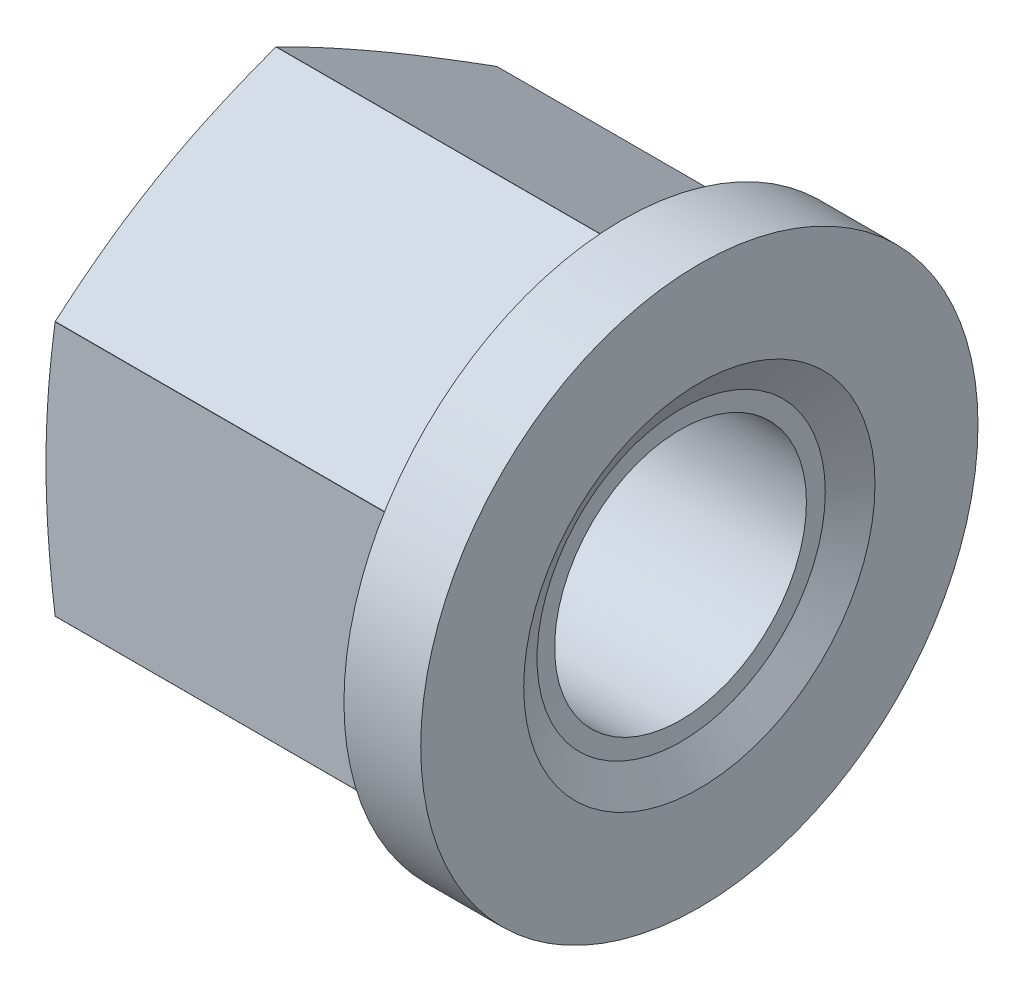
ISO-10303-21;
HEADER;
FILE_DESCRIPTION(('STEP AP214'),'2;1');
FILE_NAME('part.step','',(''),(''),'','','');
FILE_SCHEMA(('AUTOMOTIVE_DESIGN { 1 0 10303 214 1 1 1 1 }'));
ENDSEC;
DATA;
#1=APPLICATION_CONTEXT('core data for automotive mechanical design processes');
#2=APPLICATION_PROTOCOL_DEFINITION('international standard','automotive_design',2000,#1);
#3=PRODUCT_CONTEXT('',#1,'mechanical');
#4=PRODUCT('Part','Part','',(#3));
#5=PRODUCT_RELATED_PRODUCT_CATEGORY('part','',(#4));
#6=PRODUCT_DEFINITION_FORMATION('','',#4);
#7=PRODUCT_DEFINITION_CONTEXT('part definition',#1,'design');
#8=PRODUCT_DEFINITION('design','',#6,#7);
#9=PRODUCT_DEFINITION_SHAPE('','',#8);
#10=(LENGTH_UNIT() NAMED_UNIT(*) SI_UNIT(.MILLI.,.METRE.));
#11=(NAMED_UNIT(*) PLANE_ANGLE_UNIT() SI_UNIT($,.RADIAN.));
#12=(NAMED_UNIT(*) SI_UNIT($,.STERADIAN.) SOLID_ANGLE_UNIT());
#13=UNCERTAINTY_MEASURE_WITH_UNIT(LENGTH_MEASURE(1.E-05),#10,'distance_accuracy_value','');
#14=(GEOMETRIC_REPRESENTATION_CONTEXT(3) GLOBAL_UNCERTAINTY_ASSIGNED_CONTEXT((#13)) GLOBAL_UNIT_ASSIGNED_CONTEXT((#10,
#11,#12)) REPRESENTATION_CONTEXT('',''));
#15=CARTESIAN_POINT('',(0.,0.,0.));
#16=DIRECTION('',(0.,0.,1.));
#17=DIRECTION('',(1.,0.,0.));
#18=AXIS2_PLACEMENT_3D('',#15,#16,#17);
#19=CARTESIAN_POINT('',(-8.,29.,0.));
#20=DIRECTION('',(-1.,0.,0.));
#21=DIRECTION('',(0.,0.,1.));
#22=AXIS2_PLACEMENT_3D('',#19,#20,#21);
#23=PLANE('',#22);
#24=DIRECTION('',(0.,-0.5,0.866025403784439));
#25=VECTOR('',#24,1.);
#26=CARTESIAN_POINT('',(-8.,27.1685842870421,-1.05736835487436));
#27=LINE('',#26,#25);
#28=CARTESIAN_POINT('',(-8.,13.2871722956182,22.9859424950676));
#29=VERTEX_POINT('',#28);
#30=CARTESIAN_POINT('',(-8.,13.2790561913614,23.));
#31=VERTEX_POINT('',#30);
#32=EDGE_CURVE('E194',#29,#31,#27,.T.);
#33=ORIENTED_EDGE('',*,*,#32,.F.);
#34=CARTESIAN_POINT('',(-8.,0.,0.));
#35=DIRECTION('',(1.,0.,0.));
#36=DIRECTION('',(0.,0.,-1.));
#37=AXIS2_PLACEMENT_3D('',#34,#35,#36);
#38=CIRCLE('',#37,26.55);
#39=CARTESIAN_POINT('',(-8.,13.2628239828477,23.));
#40=VERTEX_POINT('',#39);
#41=EDGE_CURVE('E458',#29,#40,#38,.T.);
#42=ORIENTED_EDGE('',*,*,#41,.T.);
#43=DIRECTION('',(0.,-1.,0.));
#44=VECTOR('',#43,1.);
#45=CARTESIAN_POINT('',(-8.,29.,23.));
#46=LINE('',#45,#44);
#47=EDGE_CURVE('E257',#31,#40,#46,.T.);
#48=ORIENTED_EDGE('',*,*,#47,.F.);
#49=EDGE_LOOP('',(#33,#42,#48));
#50=FACE_BOUND('',#49,.T.);
#51=ADVANCED_FACE('F36',(#50),#23,.T.);
#52=CARTESIAN_POINT('',(-8.,-13.2628239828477,23.));
#53=VERTEX_POINT('',#52);
#54=CARTESIAN_POINT('',(-8.,-13.2790561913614,23.));
#55=VERTEX_POINT('',#54);
#56=EDGE_CURVE('E255',#53,#55,#46,.T.);
#57=ORIENTED_EDGE('',*,*,#56,.F.);
#58=CARTESIAN_POINT('',(-8.,-13.2871722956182,22.9859424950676));
#59=VERTEX_POINT('',#58);
#60=EDGE_CURVE('E456',#53,#59,#38,.T.);
#61=ORIENTED_EDGE('',*,*,#60,.T.);
#62=DIRECTION('',(0.,-0.5,-0.866025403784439));
#63=VECTOR('',#62,1.);
#64=CARTESIAN_POINT('',(-8.,-12.6685842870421,24.0573683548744));
#65=LINE('',#64,#63);
#66=EDGE_CURVE('E250',#55,#59,#65,.T.);
#67=ORIENTED_EDGE('',*,*,#66,.F.);
#68=EDGE_LOOP('',(#57,#61,#67));
#69=FACE_BOUND('',#68,.T.);
#70=ADVANCED_FACE('F369',(#69),#23,.T.);
#71=CARTESIAN_POINT('',(-8.,-26.5499962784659,0.0140575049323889));
#72=VERTEX_POINT('',#71);
#73=CARTESIAN_POINT('',(-8.,-26.5581123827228,0.));
#74=VERTEX_POINT('',#73);
#75=EDGE_CURVE('E248',#72,#74,#65,.T.);
#76=ORIENTED_EDGE('',*,*,#75,.F.);
#77=CARTESIAN_POINT('',(-8.,-26.5499962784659,-0.0140575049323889));
#78=VERTEX_POINT('',#77);
#79=EDGE_CURVE('E453',#72,#78,#38,.T.);
#80=ORIENTED_EDGE('',*,*,#79,.T.);
#81=DIRECTION('',(0.,0.5,-0.866025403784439));
#82=VECTOR('',#81,1.);
#83=CARTESIAN_POINT('',(-8.,-12.6685842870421,-24.0573683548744));
#84=LINE('',#83,#82);
#85=EDGE_CURVE('E243',#74,#78,#84,.T.);
#86=ORIENTED_EDGE('',*,*,#85,.F.);
#87=EDGE_LOOP('',(#76,#80,#86));
#88=FACE_BOUND('',#87,.T.);
#89=ADVANCED_FACE('F376',(#88),#23,.T.);
#90=CARTESIAN_POINT('',(-8.,-13.2871722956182,-22.9859424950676));
#91=VERTEX_POINT('',#90);
#92=CARTESIAN_POINT('',(-8.,-13.2790561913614,-23.));
#93=VERTEX_POINT('',#92);
#94=EDGE_CURVE('E241',#91,#93,#84,.T.);
#95=ORIENTED_EDGE('',*,*,#94,.F.);
#96=CARTESIAN_POINT('',(-8.,-13.2628239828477,-23.));
#97=VERTEX_POINT('',#96);
#98=EDGE_CURVE('E272',#91,#97,#38,.T.);
#99=ORIENTED_EDGE('',*,*,#98,.T.);
#100=DIRECTION('',(0.,1.,0.));
#101=VECTOR('',#100,1.);
#102=CARTESIAN_POINT('',(-8.,29.,-23.));
#103=LINE('',#102,#101);
#104=EDGE_CURVE('E236',#93,#97,#103,.T.);
#105=ORIENTED_EDGE('',*,*,#104,.F.);
#106=EDGE_LOOP('',(#95,#99,#105));
#107=FACE_BOUND('',#106,.T.);
#108=ADVANCED_FACE('F393',(#107),#23,.T.);
#109=CARTESIAN_POINT('',(-8.,13.2628239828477,-23.));
#110=VERTEX_POINT('',#109);
#111=CARTESIAN_POINT('',(-8.,13.2790561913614,-23.));
#112=VERTEX_POINT('',#111);
#113=EDGE_CURVE('E234',#110,#112,#103,.T.);
#114=ORIENTED_EDGE('',*,*,#113,.F.);
#115=CARTESIAN_POINT('',(-8.,13.2871722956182,-22.9859424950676));
#116=VERTEX_POINT('',#115);
#117=EDGE_CURVE('E274',#110,#116,#38,.T.);
#118=ORIENTED_EDGE('',*,*,#117,.T.);
#119=DIRECTION('',(0.,0.5,0.866025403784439));
#120=VECTOR('',#119,1.);
#121=CARTESIAN_POINT('',(-8.,27.1685842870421,1.05736835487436));
#122=LINE('',#121,#120);
#123=EDGE_CURVE('E229',#112,#116,#122,.T.);
#124=ORIENTED_EDGE('',*,*,#123,.F.);
#125=EDGE_LOOP('',(#114,#118,#124));
#126=FACE_BOUND('',#125,.T.);
#127=ADVANCED_FACE('F382',(#126),#23,.T.);
#128=CARTESIAN_POINT('',(0.,0.,0.));
#129=DIRECTION('',(1.,0.,0.));
#130=DIRECTION('',(0.,0.,-1.));
#131=AXIS2_PLACEMENT_3D('',#128,#129,#130);
#132=CYLINDRICAL_SURFACE('',#131,26.55);
#133=DIRECTION('',(1.,0.,0.));
#134=VECTOR('',#133,1.);
#135=CARTESIAN_POINT('',(0.,26.5499962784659,0.0140575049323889));
#136=LINE('',#135,#134);
#137=CARTESIAN_POINT('',(-8.,26.5499962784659,0.0140575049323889));
#138=VERTEX_POINT('',#137);
#139=CARTESIAN_POINT('',(-44.0487803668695,26.5499962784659,0.014057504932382));
#140=VERTEX_POINT('',#139);
#141=EDGE_CURVE('E260',#138,#140,#136,.F.);
#142=ORIENTED_EDGE('',*,*,#141,.F.);
#143=CARTESIAN_POINT('',(-8.,26.5499962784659,-0.0140575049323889));
#144=VERTEX_POINT('',#143);
#145=EDGE_CURVE('E278',#144,#138,#38,.T.);
#146=ORIENTED_EDGE('',*,*,#145,.F.);
#147=DIRECTION('',(1.,0.,0.));
#148=VECTOR('',#147,1.);
#149=CARTESIAN_POINT('',(0.,26.5499962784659,-0.0140575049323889));
#150=LINE('',#149,#148);
#151=CARTESIAN_POINT('',(-44.0487803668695,26.5499962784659,-0.0140575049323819));
#152=VERTEX_POINT('',#151);
#153=EDGE_CURVE('E197',#152,#144,#150,.T.);
#154=ORIENTED_EDGE('',*,*,#153,.F.);
#155=CARTESIAN_POINT('',(-44.0487803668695,0.,0.));
#156=DIRECTION('',(1.,0.,0.));
#157=DIRECTION('',(0.,0.,-1.));
#158=AXIS2_PLACEMENT_3D('',#155,#156,#157);
#159=CIRCLE('',#158,26.55);
#160=EDGE_CURVE('E273',#152,#140,#159,.T.);
#161=ORIENTED_EDGE('',*,*,#160,.T.);
#162=EDGE_LOOP('',(#142,#146,#154,#161));
#163=FACE_BOUND('',#162,.T.);
#164=ADVANCED_FACE('F388',(#163),#132,.T.);
#165=DIRECTION('',(1.,0.,0.));
#166=VECTOR('',#165,1.);
#167=CARTESIAN_POINT('',(0.,13.2871722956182,22.9859424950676));
#168=LINE('',#167,#166);
#169=CARTESIAN_POINT('',(-44.0487803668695,13.2871722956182,22.9859424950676));
#170=VERTEX_POINT('',#169);
#171=EDGE_CURVE('E258',#170,#29,#168,.T.);
#172=ORIENTED_EDGE('',*,*,#171,.F.);
#173=CARTESIAN_POINT('',(-44.0487803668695,13.2628239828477,23.));
#174=VERTEX_POINT('',#173);
#175=EDGE_CURVE('E467',#170,#174,#159,.T.);
#176=ORIENTED_EDGE('',*,*,#175,.T.);
#177=DIRECTION('',(1.,0.,0.));
#178=VECTOR('',#177,1.);
#179=CARTESIAN_POINT('',(0.,13.2628239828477,23.));
#180=LINE('',#179,#178);
#181=EDGE_CURVE('E253',#40,#174,#180,.F.);
#182=ORIENTED_EDGE('',*,*,#181,.F.);
#183=ORIENTED_EDGE('',*,*,#41,.F.);
#184=EDGE_LOOP('',(#172,#176,#182,#183));
#185=FACE_BOUND('',#184,.T.);
#186=ADVANCED_FACE('F399',(#185),#132,.T.);
#187=DIRECTION('',(1.,0.,0.));
#188=VECTOR('',#187,1.);
#189=CARTESIAN_POINT('',(0.,-13.2628239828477,23.));
#190=LINE('',#189,#188);
#191=CARTESIAN_POINT('',(-44.0487803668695,-13.2628239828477,23.));
#192=VERTEX_POINT('',#191);
#193=EDGE_CURVE('E251',#192,#53,#190,.T.);
#194=ORIENTED_EDGE('',*,*,#193,.F.);
#195=CARTESIAN_POINT('',(-44.0487803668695,-13.2871722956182,22.9859424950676));
#196=VERTEX_POINT('',#195);
#197=EDGE_CURVE('E465',#192,#196,#159,.T.);
#198=ORIENTED_EDGE('',*,*,#197,.T.);
#199=DIRECTION('',(1.,0.,0.));
#200=VECTOR('',#199,1.);
#201=CARTESIAN_POINT('',(0.,-13.2871722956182,22.9859424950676));
#202=LINE('',#201,#200);
#203=EDGE_CURVE('E246',#59,#196,#202,.F.);
#204=ORIENTED_EDGE('',*,*,#203,.F.);
#205=ORIENTED_EDGE('',*,*,#60,.F.);
#206=EDGE_LOOP('',(#194,#198,#204,#205));
#207=FACE_BOUND('',#206,.T.);
#208=ADVANCED_FACE('F498',(#207),#132,.T.);
#209=DIRECTION('',(1.,0.,0.));
#210=VECTOR('',#209,1.);
#211=CARTESIAN_POINT('',(0.,-26.5499962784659,0.0140575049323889));
#212=LINE('',#211,#210);
#213=CARTESIAN_POINT('',(-44.0487803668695,-26.5499962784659,0.0140575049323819));
#214=VERTEX_POINT('',#213);
#215=EDGE_CURVE('E244',#214,#72,#212,.T.);
#216=ORIENTED_EDGE('',*,*,#215,.F.);
#217=CARTESIAN_POINT('',(-44.0487803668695,-26.5499962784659,-0.014057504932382));
#218=VERTEX_POINT('',#217);
#219=EDGE_CURVE('E444',#214,#218,#159,.T.);
#220=ORIENTED_EDGE('',*,*,#219,.T.);
#221=DIRECTION('',(1.,0.,0.));
#222=VECTOR('',#221,1.);
#223=CARTESIAN_POINT('',(0.,-26.5499962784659,-0.0140575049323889));
#224=LINE('',#223,#222);
#225=EDGE_CURVE('E239',#78,#218,#224,.F.);
#226=ORIENTED_EDGE('',*,*,#225,.F.);
#227=ORIENTED_EDGE('',*,*,#79,.F.);
#228=EDGE_LOOP('',(#216,#220,#226,#227));
#229=FACE_BOUND('',#228,.T.);
#230=ADVANCED_FACE('F450',(#229),#132,.T.);
#231=DIRECTION('',(1.,0.,0.));
#232=VECTOR('',#231,1.);
#233=CARTESIAN_POINT('',(0.,-13.2871722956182,-22.9859424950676));
#234=LINE('',#233,#232);
#235=CARTESIAN_POINT('',(-44.0487803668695,-13.2871722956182,-22.9859424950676));
#236=VERTEX_POINT('',#235);
#237=EDGE_CURVE('E237',#236,#91,#234,.T.);
#238=ORIENTED_EDGE('',*,*,#237,.F.);
#239=CARTESIAN_POINT('',(-44.0487803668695,-13.2628239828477,-23.));
#240=VERTEX_POINT('',#239);
#241=EDGE_CURVE('E266',#236,#240,#159,.T.);
#242=ORIENTED_EDGE('',*,*,#241,.T.);
#243=DIRECTION('',(1.,0.,0.));
#244=VECTOR('',#243,1.);
#245=CARTESIAN_POINT('',(0.,-13.2628239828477,-23.));
#246=LINE('',#245,#244);
#247=EDGE_CURVE('E232',#97,#240,#246,.F.);
#248=ORIENTED_EDGE('',*,*,#247,.F.);
#249=ORIENTED_EDGE('',*,*,#98,.F.);
#250=EDGE_LOOP('',(#238,#242,#248,#249));
#251=FACE_BOUND('',#250,.T.);
#252=ADVANCED_FACE('F389',(#251),#132,.T.);
#253=CARTESIAN_POINT('',(-44.0487803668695,0.,0.));
#254=DIRECTION('',(1.,0.,0.));
#255=DIRECTION('',(0.,0.,-1.));
#256=AXIS2_PLACEMENT_3D('',#253,#254,#255);
#257=CONICAL_SURFACE('',#256,26.55,1.30899693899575);
#258=CARTESIAN_POINT('',(-44.0487258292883,26.5502,0.01370464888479));
#259=CARTESIAN_POINT('',(-44.1224554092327,26.274772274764,0.490759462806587));
#260=CARTESIAN_POINT('',(-44.192806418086,25.999121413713,0.968200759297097));
#261=CARTESIAN_POINT('',(-44.3260498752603,25.4473563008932,1.92388596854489));
#262=CARTESIAN_POINT('',(-44.388941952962,25.1712420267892,2.4021299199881));
#263=CARTESIAN_POINT('',(-44.5654089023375,24.3420226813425,3.83837995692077));
#264=CARTESIAN_POINT('',(-44.6667209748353,23.788237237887,4.79756448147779));
#265=CARTESIAN_POINT('',(-44.7899803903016,22.9579432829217,6.23567579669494));
#266=CARTESIAN_POINT('',(-44.8262254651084,22.681951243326,6.71370803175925));
#267=CARTESIAN_POINT('',(-44.8887866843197,22.1296877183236,7.67025651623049));
#268=CARTESIAN_POINT('',(-44.9151030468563,21.8534162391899,8.14877275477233));
#269=CARTESIAN_POINT('',(-44.9573801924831,21.3007234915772,9.10606467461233));
#270=CARTESIAN_POINT('',(-44.97334279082,21.0243022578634,9.5848402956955));
#271=CARTESIAN_POINT('',(-44.9946544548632,20.4713572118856,10.5425692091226));
#272=CARTESIAN_POINT('',(-45.0000035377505,20.1948333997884,11.0215225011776));
#273=CARTESIAN_POINT('',(-44.9999964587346,19.6417858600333,11.9794289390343));
#274=CARTESIAN_POINT('',(-44.9946402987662,19.3652621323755,12.4583820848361));
#275=CARTESIAN_POINT('',(-44.9733146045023,18.8123173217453,13.416110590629));
#276=CARTESIAN_POINT('',(-44.9573450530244,18.53589623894,13.8948859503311));
#277=CARTESIAN_POINT('',(-44.9150542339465,17.9832038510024,14.8521772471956));
#278=CARTESIAN_POINT('',(-44.8887311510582,17.7069325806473,15.3306931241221));
#279=CARTESIAN_POINT('',(-44.8261568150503,17.1546695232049,16.2872407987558));
#280=CARTESIAN_POINT('',(-44.7899053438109,16.8786777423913,16.7652725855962));
#281=CARTESIAN_POINT('',(-44.6666272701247,16.0483846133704,18.2033824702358));
#282=CARTESIAN_POINT('',(-44.5653035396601,15.4945997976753,19.1625659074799));
#283=CARTESIAN_POINT('',(-44.3888205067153,14.6653814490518,20.5988142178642));
#284=CARTESIAN_POINT('',(-44.3259233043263,14.3892675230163,21.077057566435));
#285=CARTESIAN_POINT('',(-44.1926700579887,13.8375031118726,22.0327415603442));
#286=CARTESIAN_POINT('',(-44.1223143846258,13.5618526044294,22.510182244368));
#287=CARTESIAN_POINT('',(-44.0485803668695,13.286425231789,22.9872364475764));
#288=B_SPLINE_CURVE_WITH_KNOTS('',3,(#258,#259,#260,#261,#262,#263,#264,#265,#266,#267,#268,
#269,#270,#271,#272,#273,#274,#275,#276,#277,#278,#279,#280,#281,#282,#283,#284,#285,#286,#287),
.UNSPECIFIED.,.F.,.F.,(4,2,2,2,2,2,2,2,2,2,2,2,2,2,4),(0.,1.66727573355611,3.33463427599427,
6.67053877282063,8.32998590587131,9.98939657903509,11.6485162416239,13.3076332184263,
14.9667498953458,16.6258692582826,18.2852796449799,19.9447264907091,23.2806304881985,
24.9479887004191,26.615264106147),.UNSPECIFIED.);
#289=CARTESIAN_POINT('',(-45.,19.9185842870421,11.5));
#290=VERTEX_POINT('',#289);
#291=EDGE_CURVE('E11',#140,#290,#288,.T.);
#292=ORIENTED_EDGE('',*,*,#291,.F.);
#293=ORIENTED_EDGE('',*,*,#160,.F.);
#294=CARTESIAN_POINT('',(-44.0485803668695,13.286425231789,-22.9872364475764));
#295=CARTESIAN_POINT('',(-44.1223143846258,13.5618526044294,-22.510182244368));
#296=CARTESIAN_POINT('',(-44.1926700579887,13.8375031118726,-22.0327415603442));
#297=CARTESIAN_POINT('',(-44.3259233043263,14.3892675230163,-21.077057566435));
#298=CARTESIAN_POINT('',(-44.3888205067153,14.6653814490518,-20.5988142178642));
#299=CARTESIAN_POINT('',(-44.5653035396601,15.4945997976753,-19.1625659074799));
#300=CARTESIAN_POINT('',(-44.6666272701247,16.0483846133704,-18.2033824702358));
#301=CARTESIAN_POINT('',(-44.7899053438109,16.8786777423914,-16.7652725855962));
#302=CARTESIAN_POINT('',(-44.8261568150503,17.1546695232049,-16.2872407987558));
#303=CARTESIAN_POINT('',(-44.8887311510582,17.7069325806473,-15.3306931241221));
#304=CARTESIAN_POINT('',(-44.9150542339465,17.9832038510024,-14.8521772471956));
#305=CARTESIAN_POINT('',(-44.9573450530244,18.53589623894,-13.8948859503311));
#306=CARTESIAN_POINT('',(-44.9733146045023,18.8123173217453,-13.416110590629));
#307=CARTESIAN_POINT('',(-44.9946402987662,19.3652621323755,-12.4583820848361));
#308=CARTESIAN_POINT('',(-44.9999964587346,19.6417858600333,-11.9794289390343));
#309=CARTESIAN_POINT('',(-45.0000035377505,20.1948333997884,-11.0215225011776));
#310=CARTESIAN_POINT('',(-44.9946544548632,20.4713572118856,-10.5425692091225));
#311=CARTESIAN_POINT('',(-44.97334279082,21.0243022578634,-9.58484029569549));
#312=CARTESIAN_POINT('',(-44.9573801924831,21.3007234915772,-9.10606467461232));
#313=CARTESIAN_POINT('',(-44.9151030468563,21.8534162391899,-8.14877275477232));
#314=CARTESIAN_POINT('',(-44.8887866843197,22.1296877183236,-7.67025651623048));
#315=CARTESIAN_POINT('',(-44.8262254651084,22.681951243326,-6.71370803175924));
#316=CARTESIAN_POINT('',(-44.7899803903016,22.9579432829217,-6.23567579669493));
#317=CARTESIAN_POINT('',(-44.6667209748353,23.788237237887,-4.79756448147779));
#318=CARTESIAN_POINT('',(-44.5654089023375,24.3420226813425,-3.83837995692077));
#319=CARTESIAN_POINT('',(-44.388941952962,25.1712420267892,-2.4021299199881));
#320=CARTESIAN_POINT('',(-44.3260498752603,25.4473563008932,-1.92388596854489));
#321=CARTESIAN_POINT('',(-44.192806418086,25.999121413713,-0.968200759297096));
#322=CARTESIAN_POINT('',(-44.1224554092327,26.274772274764,-0.490759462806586));
#323=CARTESIAN_POINT('',(-44.0487258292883,26.5502,-0.0137046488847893));
#324=B_SPLINE_CURVE_WITH_KNOTS('',3,(#294,#295,#296,#297,#298,#299,#300,#301,#302,#303,#304,
#305,#306,#307,#308,#309,#310,#311,#312,#313,#314,#315,#316,#317,#318,#319,#320,#321,#322,#323),
.UNSPECIFIED.,.F.,.F.,(4,2,2,2,2,2,2,2,2,2,2,2,2,2,4),(0.,1.66727540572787,3.33463361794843,
6.67053761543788,8.32998446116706,9.98939484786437,11.6485142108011,13.3076308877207,
14.9667478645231,16.6258675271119,18.2852782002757,19.9447253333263,23.2806298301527,
24.9479883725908,26.615264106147),.UNSPECIFIED.);
#325=CARTESIAN_POINT('',(-45.,19.9185842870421,-11.5));
#326=VERTEX_POINT('',#325);
#327=EDGE_CURVE('E299',#326,#152,#324,.T.);
#328=ORIENTED_EDGE('',*,*,#327,.F.);
#329=CARTESIAN_POINT('',(-45.,0.,0.));
#330=DIRECTION('',(1.,0.,0.));
#331=DIRECTION('',(0.,0.,-1.));
#332=AXIS2_PLACEMENT_3D('',#329,#330,#331);
#333=CIRCLE('',#332,23.);
#334=EDGE_CURVE('E267',#326,#290,#333,.T.);
#335=ORIENTED_EDGE('',*,*,#334,.T.);
#336=EDGE_LOOP('',(#292,#293,#328,#335));
#337=FACE_BOUND('',#336,.T.);
#338=ADVANCED_FACE('F365',(#337),#257,.T.);
#339=EDGE_CURVE('E45',#290,#170,#288,.T.);
#340=ORIENTED_EDGE('',*,*,#339,.F.);
#341=CARTESIAN_POINT('',(-45.,0.,23.));
#342=VERTEX_POINT('',#341);
#343=EDGE_CURVE('E427',#290,#342,#333,.T.);
#344=ORIENTED_EDGE('',*,*,#343,.T.);
#345=CARTESIAN_POINT('',(-39.916773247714,-35.1077360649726,23.));
#346=CARTESIAN_POINT('',(-40.0336797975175,-34.5861330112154,23.));
#347=CARTESIAN_POINT('',(-40.1498461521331,-34.0643641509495,23.));
#348=CARTESIAN_POINT('',(-40.3805358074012,-33.0204615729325,23.));
#349=CARTESIAN_POINT('',(-40.4950591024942,-32.498327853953,23.));
#350=CARTESIAN_POINT('',(-40.8359283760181,-30.9312927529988,23.));
#351=CARTESIAN_POINT('',(-41.0595642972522,-29.8857994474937,23.));
#352=CARTESIAN_POINT('',(-41.4982026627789,-27.7919251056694,23.));
#353=CARTESIAN_POINT('',(-41.7131963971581,-26.7435422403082,23.));
#354=CARTESIAN_POINT('',(-42.1322446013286,-24.6445932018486,23.));
#355=CARTESIAN_POINT('',(-42.3362991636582,-23.5940270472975,23.));
#356=CARTESIAN_POINT('',(-42.7292823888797,-21.4987298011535,23.));
#357=CARTESIAN_POINT('',(-42.9183187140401,-20.454019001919,23.));
#358=CARTESIAN_POINT('',(-43.2798706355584,-18.361720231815,23.));
#359=CARTESIAN_POINT('',(-43.4523861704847,-17.3141322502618,23.));
#360=CARTESIAN_POINT('',(-43.7769990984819,-15.2159160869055,23.));
#361=CARTESIAN_POINT('',(-43.9290993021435,-14.1652883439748,23.));
#362=CARTESIAN_POINT('',(-44.2084012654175,-12.0606971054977,23.));
#363=CARTESIAN_POINT('',(-44.3356030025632,-11.0067336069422,23.));
#364=CARTESIAN_POINT('',(-44.5614912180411,-8.88355569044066,23.));
#365=CARTESIAN_POINT('',(-44.6598368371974,-7.81430417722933,23.));
#366=CARTESIAN_POINT('',(-44.7809104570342,-6.20845598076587,23.));
#367=CARTESIAN_POINT('',(-44.8168611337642,-5.67283834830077,23.));
#368=CARTESIAN_POINT('',(-44.8794576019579,-4.60106308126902,23.));
#369=CARTESIAN_POINT('',(-44.9061035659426,-4.06490545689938,23.));
#370=CARTESIAN_POINT('',(-44.9496808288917,-2.99242535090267,23.));
#371=CARTESIAN_POINT('',(-44.9666162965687,-2.45610303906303,23.));
#372=CARTESIAN_POINT('',(-44.990526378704,-1.38324433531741,23.));
#373=CARTESIAN_POINT('',(-44.9975011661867,-0.846707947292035,23.));
#374=CARTESIAN_POINT('',(-45.0013782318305,0.226405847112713,23.));
#375=CARTESIAN_POINT('',(-44.99828042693,0.762983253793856,23.));
#376=CARTESIAN_POINT('',(-44.9820624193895,1.8359856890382,23.));
#377=CARTESIAN_POINT('',(-44.9689422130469,2.37241071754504,23.));
#378=CARTESIAN_POINT('',(-44.9328205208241,3.44687219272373,23.));
#379=CARTESIAN_POINT('',(-44.9097834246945,3.98490744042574,23.));
#380=CARTESIAN_POINT('',(-44.8541789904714,5.06048830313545,23.));
#381=CARTESIAN_POINT('',(-44.821611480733,5.59803390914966,23.));
#382=CARTESIAN_POINT('',(-44.7102971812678,7.20972212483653,23.));
#383=CARTESIAN_POINT('',(-44.6179376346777,8.28294416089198,23.));
#384=CARTESIAN_POINT('',(-44.4015310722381,10.4268200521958,23.));
#385=CARTESIAN_POINT('',(-44.277463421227,11.497471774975,23.));
#386=CARTESIAN_POINT('',(-44.0028095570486,13.6353376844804,23.));
#387=CARTESIAN_POINT('',(-43.8522232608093,14.7025518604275,23.));
#388=CARTESIAN_POINT('',(-43.5401756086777,16.762124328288,23.));
#389=CARTESIAN_POINT('',(-43.3801229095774,17.7546983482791,23.));
#390=CARTESIAN_POINT('',(-43.0445104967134,19.7372345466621,23.));
#391=CARTESIAN_POINT('',(-42.8689503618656,20.7271966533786,23.));
#392=CARTESIAN_POINT('',(-42.5051503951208,22.7048791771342,23.));
#393=CARTESIAN_POINT('',(-42.316909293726,23.6925993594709,23.));
#394=CARTESIAN_POINT('',(-41.9300825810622,25.6659954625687,23.));
#395=CARTESIAN_POINT('',(-41.7314970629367,26.6516714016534,23.));
#396=CARTESIAN_POINT('',(-41.3257978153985,28.6215054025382,23.));
#397=CARTESIAN_POINT('',(-41.1186820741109,29.6056630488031,23.));
#398=CARTESIAN_POINT('',(-40.6974607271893,31.5724797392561,23.));
#399=CARTESIAN_POINT('',(-40.4833551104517,32.5551387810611,23.));
#400=CARTESIAN_POINT('',(-40.0493633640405,34.5191135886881,23.));
#401=CARTESIAN_POINT('',(-39.8294775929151,35.5004294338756,23.));
#402=CARTESIAN_POINT('',(-39.3848712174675,37.4619629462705,23.));
#403=CARTESIAN_POINT('',(-39.1601506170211,38.4421806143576,23.));
#404=CARTESIAN_POINT('',(-38.708876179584,40.3920447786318,23.));
#405=CARTESIAN_POINT('',(-38.4823620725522,41.3617004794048,23.));
#406=CARTESIAN_POINT('',(-38.0259543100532,43.300216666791,23.));
#407=CARTESIAN_POINT('',(-37.7960606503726,44.2690771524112,23.));
#408=CARTESIAN_POINT('',(-37.1020710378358,47.174662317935,23.));
#409=CARTESIAN_POINT('',(-36.633673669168,49.110359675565,23.));
#410=CARTESIAN_POINT('',(-35.6889889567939,52.9773002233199,23.));
#411=CARTESIAN_POINT('',(-35.2127120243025,54.9085459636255,23.));
#412=CARTESIAN_POINT('',(-34.4934773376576,57.8041827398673,23.));
#413=CARTESIAN_POINT('',(-34.252933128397,58.7691742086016,23.));
#414=CARTESIAN_POINT('',(-33.7704219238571,60.6988003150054,23.));
#415=CARTESIAN_POINT('',(-33.5284549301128,61.6634349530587,23.));
#416=CARTESIAN_POINT('',(-33.2858693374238,62.6279139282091,23.));
#417=B_SPLINE_CURVE_WITH_KNOTS('',3,(#345,#346,#347,#348,#349,#350,#351,#352,#353,#354,#355,
#356,#357,#358,#359,#360,#361,#362,#363,#364,#365,#366,#367,#368,#369,#370,#371,#372,#373,#374,
#375,#376,#377,#378,#379,#380,#381,#382,#383,#384,#385,#386,#387,#388,#389,#390,#391,#392,#393,
#394,#395,#396,#397,#398,#399,#400,#401,#402,#403,#404,#405,#406,#407,#408,#409,#410,#411,#412,
#413,#414,#415,#416),.UNSPECIFIED.,.F.,.F.,(4,2,2,2,2,2,2,2,2,2,2,2,2,2,2,2,2,2,2,2,2,2,2,2,2,2,
2,2,2,2,2,2,2,2,2,4),(0.,1.60362986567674,3.20726515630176,6.4146649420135,9.62522011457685,
12.8357481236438,16.0206691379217,19.2056019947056,22.3900959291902,25.5745927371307,
28.7953171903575,30.4057179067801,32.0160887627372,33.6257677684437,35.2354188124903,
36.845083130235,38.4547480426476,40.0702419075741,41.6857648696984,44.9167267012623,
48.1497965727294,51.3828765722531,54.3989192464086,57.4150438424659,60.4314708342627,
63.4478706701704,66.4649860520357,69.4821062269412,72.4990396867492,75.5159707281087,
78.5032478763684,81.4905287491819,87.4651860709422,93.432495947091,96.4160550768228,
99.3996109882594),.UNSPECIFIED.);
#418=EDGE_CURVE('E349',#174,#342,#417,.F.);
#419=ORIENTED_EDGE('',*,*,#418,.F.);
#420=ORIENTED_EDGE('',*,*,#175,.F.);
#421=EDGE_LOOP('',(#340,#344,#419,#420));
#422=FACE_BOUND('',#421,.T.);
#423=ADVANCED_FACE('F482',(#422),#257,.T.);
#424=EDGE_CURVE('E345',#342,#192,#417,.F.);
#425=ORIENTED_EDGE('',*,*,#424,.F.);
#426=CARTESIAN_POINT('',(-45.,-19.9185842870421,11.5));
#427=VERTEX_POINT('',#426);
#428=EDGE_CURVE('E430',#342,#427,#333,.T.);
#429=ORIENTED_EDGE('',*,*,#428,.T.);
#430=CARTESIAN_POINT('',(-44.0485803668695,-13.286425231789,22.9872364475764));
#431=CARTESIAN_POINT('',(-44.1223143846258,-13.5618526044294,22.510182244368));
#432=CARTESIAN_POINT('',(-44.1926700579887,-13.8375031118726,22.0327415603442));
#433=CARTESIAN_POINT('',(-44.3259233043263,-14.3892675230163,21.077057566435));
#434=CARTESIAN_POINT('',(-44.3888205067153,-14.6653814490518,20.5988142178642));
#435=CARTESIAN_POINT('',(-44.5653035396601,-15.4945997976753,19.1625659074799));
#436=CARTESIAN_POINT('',(-44.6666272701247,-16.0483846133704,18.2033824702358));
#437=CARTESIAN_POINT('',(-44.7899053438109,-16.8786777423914,16.7652725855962));
#438=CARTESIAN_POINT('',(-44.8261568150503,-17.1546695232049,16.2872407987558));
#439=CARTESIAN_POINT('',(-44.8887311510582,-17.7069325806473,15.3306931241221));
#440=CARTESIAN_POINT('',(-44.9150542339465,-17.9832038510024,14.8521772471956));
#441=CARTESIAN_POINT('',(-44.9573450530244,-18.53589623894,13.8948859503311));
#442=CARTESIAN_POINT('',(-44.9733146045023,-18.8123173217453,13.416110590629));
#443=CARTESIAN_POINT('',(-44.9946402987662,-19.3652621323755,12.4583820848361));
#444=CARTESIAN_POINT('',(-44.9999964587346,-19.6417858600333,11.9794289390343));
#445=CARTESIAN_POINT('',(-45.0000035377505,-20.1948333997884,11.0215225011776));
#446=CARTESIAN_POINT('',(-44.9946544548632,-20.4713572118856,10.5425692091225));
#447=CARTESIAN_POINT('',(-44.97334279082,-21.0243022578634,9.58484029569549));
#448=CARTESIAN_POINT('',(-44.9573801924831,-21.3007234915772,9.10606467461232));
#449=CARTESIAN_POINT('',(-44.9151030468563,-21.8534162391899,8.14877275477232));
#450=CARTESIAN_POINT('',(-44.8887866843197,-22.1296877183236,7.67025651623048));
#451=CARTESIAN_POINT('',(-44.8262254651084,-22.681951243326,6.71370803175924));
#452=CARTESIAN_POINT('',(-44.7899803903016,-22.9579432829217,6.23567579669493));
#453=CARTESIAN_POINT('',(-44.6667209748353,-23.788237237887,4.79756448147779));
#454=CARTESIAN_POINT('',(-44.5654089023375,-24.3420226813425,3.83837995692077));
#455=CARTESIAN_POINT('',(-44.388941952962,-25.1712420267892,2.4021299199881));
#456=CARTESIAN_POINT('',(-44.3260498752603,-25.4473563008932,1.92388596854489));
#457=CARTESIAN_POINT('',(-44.192806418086,-25.999121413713,0.968200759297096));
#458=CARTESIAN_POINT('',(-44.1224554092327,-26.274772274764,0.490759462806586));
#459=CARTESIAN_POINT('',(-44.0487258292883,-26.5502,0.0137046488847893));
#460=B_SPLINE_CURVE_WITH_KNOTS('',3,(#430,#431,#432,#433,#434,#435,#436,#437,#438,#439,#440,
#441,#442,#443,#444,#445,#446,#447,#448,#449,#450,#451,#452,#453,#454,#455,#456,#457,#458,#459),
.UNSPECIFIED.,.F.,.F.,(4,2,2,2,2,2,2,2,2,2,2,2,2,2,4),(0.,1.66727540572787,3.33463361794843,
6.67053761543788,8.32998446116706,9.98939484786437,11.6485142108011,13.3076308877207,
14.9667478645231,16.6258675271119,18.2852782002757,19.9447253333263,23.2806298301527,
24.9479883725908,26.615264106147),.UNSPECIFIED.);
#461=EDGE_CURVE('E344',#196,#427,#460,.T.);
#462=ORIENTED_EDGE('',*,*,#461,.F.);
#463=ORIENTED_EDGE('',*,*,#197,.F.);
#464=EDGE_LOOP('',(#425,#429,#462,#463));
#465=FACE_BOUND('',#464,.T.);
#466=ADVANCED_FACE('F483',(#465),#257,.T.);
#467=EDGE_CURVE('E339',#427,#214,#460,.T.);
#468=ORIENTED_EDGE('',*,*,#467,.F.);
#469=CARTESIAN_POINT('',(-45.,-19.9185842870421,-11.5));
#470=VERTEX_POINT('',#469);
#471=EDGE_CURVE('E421',#427,#470,#333,.T.);
#472=ORIENTED_EDGE('',*,*,#471,.T.);
#473=CARTESIAN_POINT('',(-44.0487258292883,-26.5502,-0.01370464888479));
#474=CARTESIAN_POINT('',(-44.1224554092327,-26.274772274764,-0.490759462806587));
#475=CARTESIAN_POINT('',(-44.192806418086,-25.999121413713,-0.968200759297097));
#476=CARTESIAN_POINT('',(-44.3260498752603,-25.4473563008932,-1.92388596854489));
#477=CARTESIAN_POINT('',(-44.388941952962,-25.1712420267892,-2.4021299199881));
#478=CARTESIAN_POINT('',(-44.5654089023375,-24.3420226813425,-3.83837995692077));
#479=CARTESIAN_POINT('',(-44.6667209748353,-23.788237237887,-4.79756448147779));
#480=CARTESIAN_POINT('',(-44.7899803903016,-22.9579432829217,-6.23567579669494));
#481=CARTESIAN_POINT('',(-44.8262254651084,-22.681951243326,-6.71370803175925));
#482=CARTESIAN_POINT('',(-44.8887866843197,-22.1296877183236,-7.67025651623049));
#483=CARTESIAN_POINT('',(-44.9151030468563,-21.8534162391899,-8.14877275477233));
#484=CARTESIAN_POINT('',(-44.9573801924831,-21.3007234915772,-9.10606467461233));
#485=CARTESIAN_POINT('',(-44.97334279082,-21.0243022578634,-9.5848402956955));
#486=CARTESIAN_POINT('',(-44.9946544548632,-20.4713572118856,-10.5425692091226));
#487=CARTESIAN_POINT('',(-45.0000035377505,-20.1948333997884,-11.0215225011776));
#488=CARTESIAN_POINT('',(-44.9999964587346,-19.6417858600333,-11.9794289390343));
#489=CARTESIAN_POINT('',(-44.9946402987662,-19.3652621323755,-12.4583820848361));
#490=CARTESIAN_POINT('',(-44.9733146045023,-18.8123173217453,-13.416110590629));
#491=CARTESIAN_POINT('',(-44.9573450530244,-18.53589623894,-13.8948859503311));
#492=CARTESIAN_POINT('',(-44.9150542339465,-17.9832038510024,-14.8521772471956));
#493=CARTESIAN_POINT('',(-44.8887311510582,-17.7069325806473,-15.3306931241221));
#494=CARTESIAN_POINT('',(-44.8261568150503,-17.1546695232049,-16.2872407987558));
#495=CARTESIAN_POINT('',(-44.7899053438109,-16.8786777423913,-16.7652725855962));
#496=CARTESIAN_POINT('',(-44.6666272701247,-16.0483846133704,-18.2033824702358));
#497=CARTESIAN_POINT('',(-44.5653035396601,-15.4945997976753,-19.1625659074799));
#498=CARTESIAN_POINT('',(-44.3888205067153,-14.6653814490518,-20.5988142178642));
#499=CARTESIAN_POINT('',(-44.3259233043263,-14.3892675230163,-21.077057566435));
#500=CARTESIAN_POINT('',(-44.1926700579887,-13.8375031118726,-22.0327415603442));
#501=CARTESIAN_POINT('',(-44.1223143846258,-13.5618526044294,-22.510182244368));
#502=CARTESIAN_POINT('',(-44.0485803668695,-13.286425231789,-22.9872364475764));
#503=B_SPLINE_CURVE_WITH_KNOTS('',3,(#473,#474,#475,#476,#477,#478,#479,#480,#481,#482,#483,
#484,#485,#486,#487,#488,#489,#490,#491,#492,#493,#494,#495,#496,#497,#498,#499,#500,#501,#502),
.UNSPECIFIED.,.F.,.F.,(4,2,2,2,2,2,2,2,2,2,2,2,2,2,4),(0.,1.66727573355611,3.33463427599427,
6.67053877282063,8.32998590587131,9.98939657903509,11.6485162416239,13.3076332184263,
14.9667498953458,16.6258692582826,18.2852796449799,19.9447264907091,23.2806304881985,
24.9479887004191,26.615264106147),.UNSPECIFIED.);
#504=EDGE_CURVE('E337',#218,#470,#503,.T.);
#505=ORIENTED_EDGE('',*,*,#504,.F.);
#506=ORIENTED_EDGE('',*,*,#219,.F.);
#507=EDGE_LOOP('',(#468,#472,#505,#506));
#508=FACE_BOUND('',#507,.T.);
#509=ADVANCED_FACE('F441',(#508),#257,.T.);
#510=EDGE_CURVE('E332',#470,#236,#503,.T.);
#511=ORIENTED_EDGE('',*,*,#510,.F.);
#512=CARTESIAN_POINT('',(-45.,0.,-23.));
#513=VERTEX_POINT('',#512);
#514=EDGE_CURVE('E268',#470,#513,#333,.T.);
#515=ORIENTED_EDGE('',*,*,#514,.T.);
#516=CARTESIAN_POINT('',(-39.916773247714,-35.1077360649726,-23.));
#517=CARTESIAN_POINT('',(-40.0336797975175,-34.5861330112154,-23.));
#518=CARTESIAN_POINT('',(-40.1498461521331,-34.0643641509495,-23.));
#519=CARTESIAN_POINT('',(-40.3805358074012,-33.0204615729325,-23.));
#520=CARTESIAN_POINT('',(-40.4950591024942,-32.498327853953,-23.));
#521=CARTESIAN_POINT('',(-40.8359283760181,-30.9312927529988,-23.));
#522=CARTESIAN_POINT('',(-41.0595642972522,-29.8857994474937,-23.));
#523=CARTESIAN_POINT('',(-41.4982026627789,-27.7919251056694,-23.));
#524=CARTESIAN_POINT('',(-41.7131963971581,-26.7435422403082,-23.));
#525=CARTESIAN_POINT('',(-42.1322446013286,-24.6445932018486,-23.));
#526=CARTESIAN_POINT('',(-42.3362991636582,-23.5940270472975,-23.));
#527=CARTESIAN_POINT('',(-42.7292823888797,-21.4987298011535,-23.));
#528=CARTESIAN_POINT('',(-42.9183187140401,-20.454019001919,-23.));
#529=CARTESIAN_POINT('',(-43.2798706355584,-18.361720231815,-23.));
#530=CARTESIAN_POINT('',(-43.4523861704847,-17.3141322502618,-23.));
#531=CARTESIAN_POINT('',(-43.7769990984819,-15.2159160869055,-23.));
#532=CARTESIAN_POINT('',(-43.9290993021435,-14.1652883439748,-23.));
#533=CARTESIAN_POINT('',(-44.2084012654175,-12.0606971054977,-23.));
#534=CARTESIAN_POINT('',(-44.3356030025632,-11.0067336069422,-23.));
#535=CARTESIAN_POINT('',(-44.5614912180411,-8.88355569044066,-23.));
#536=CARTESIAN_POINT('',(-44.6598368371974,-7.81430417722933,-23.));
#537=CARTESIAN_POINT('',(-44.7809104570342,-6.20845598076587,-23.));
#538=CARTESIAN_POINT('',(-44.8168611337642,-5.67283834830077,-23.));
#539=CARTESIAN_POINT('',(-44.8794576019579,-4.60106308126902,-23.));
#540=CARTESIAN_POINT('',(-44.9061035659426,-4.06490545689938,-23.));
#541=CARTESIAN_POINT('',(-44.9496808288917,-2.99242535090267,-23.));
#542=CARTESIAN_POINT('',(-44.9666162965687,-2.45610303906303,-23.));
#543=CARTESIAN_POINT('',(-44.990526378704,-1.38324433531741,-23.));
#544=CARTESIAN_POINT('',(-44.9975011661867,-0.846707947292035,-23.));
#545=CARTESIAN_POINT('',(-45.0013782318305,0.226405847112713,-23.));
#546=CARTESIAN_POINT('',(-44.99828042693,0.762983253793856,-23.));
#547=CARTESIAN_POINT('',(-44.9820624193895,1.8359856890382,-23.));
#548=CARTESIAN_POINT('',(-44.9689422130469,2.37241071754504,-23.));
#549=CARTESIAN_POINT('',(-44.9328205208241,3.44687219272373,-23.));
#550=CARTESIAN_POINT('',(-44.9097834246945,3.98490744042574,-23.));
#551=CARTESIAN_POINT('',(-44.8541789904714,5.06048830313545,-23.));
#552=CARTESIAN_POINT('',(-44.821611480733,5.59803390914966,-23.));
#553=CARTESIAN_POINT('',(-44.7102971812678,7.20972212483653,-23.));
#554=CARTESIAN_POINT('',(-44.6179376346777,8.28294416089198,-23.));
#555=CARTESIAN_POINT('',(-44.4015310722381,10.4268200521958,-23.));
#556=CARTESIAN_POINT('',(-44.277463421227,11.497471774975,-23.));
#557=CARTESIAN_POINT('',(-44.0028095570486,13.6353376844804,-23.));
#558=CARTESIAN_POINT('',(-43.8522232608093,14.7025518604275,-23.));
#559=CARTESIAN_POINT('',(-43.5401756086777,16.762124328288,-23.));
#560=CARTESIAN_POINT('',(-43.3801229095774,17.7546983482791,-23.));
#561=CARTESIAN_POINT('',(-43.0445104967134,19.7372345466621,-23.));
#562=CARTESIAN_POINT('',(-42.8689503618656,20.7271966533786,-23.));
#563=CARTESIAN_POINT('',(-42.5051503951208,22.7048791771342,-23.));
#564=CARTESIAN_POINT('',(-42.316909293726,23.6925993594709,-23.));
#565=CARTESIAN_POINT('',(-41.9300825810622,25.6659954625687,-23.));
#566=CARTESIAN_POINT('',(-41.7314970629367,26.6516714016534,-23.));
#567=CARTESIAN_POINT('',(-41.3257978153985,28.6215054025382,-23.));
#568=CARTESIAN_POINT('',(-41.1186820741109,29.6056630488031,-23.));
#569=CARTESIAN_POINT('',(-40.6974607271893,31.5724797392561,-23.));
#570=CARTESIAN_POINT('',(-40.4833551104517,32.5551387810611,-23.));
#571=CARTESIAN_POINT('',(-40.0493633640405,34.5191135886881,-23.));
#572=CARTESIAN_POINT('',(-39.8294775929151,35.5004294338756,-23.));
#573=CARTESIAN_POINT('',(-39.3848712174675,37.4619629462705,-23.));
#574=CARTESIAN_POINT('',(-39.1601506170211,38.4421806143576,-23.));
#575=CARTESIAN_POINT('',(-38.708876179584,40.3920447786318,-23.));
#576=CARTESIAN_POINT('',(-38.4823620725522,41.3617004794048,-23.));
#577=CARTESIAN_POINT('',(-38.0259543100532,43.300216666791,-23.));
#578=CARTESIAN_POINT('',(-37.7960606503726,44.2690771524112,-23.));
#579=CARTESIAN_POINT('',(-37.1020710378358,47.174662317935,-23.));
#580=CARTESIAN_POINT('',(-36.633673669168,49.110359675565,-23.));
#581=CARTESIAN_POINT('',(-35.6889889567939,52.9773002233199,-23.));
#582=CARTESIAN_POINT('',(-35.2127120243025,54.9085459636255,-23.));
#583=CARTESIAN_POINT('',(-34.4934773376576,57.8041827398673,-23.));
#584=CARTESIAN_POINT('',(-34.252933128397,58.7691742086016,-23.));
#585=CARTESIAN_POINT('',(-33.7704219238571,60.6988003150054,-23.));
#586=CARTESIAN_POINT('',(-33.5284549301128,61.6634349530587,-23.));
#587=CARTESIAN_POINT('',(-33.2858693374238,62.6279139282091,-23.));
#588=B_SPLINE_CURVE_WITH_KNOTS('',3,(#516,#517,#518,#519,#520,#521,#522,#523,#524,#525,#526,
#527,#528,#529,#530,#531,#532,#533,#534,#535,#536,#537,#538,#539,#540,#541,#542,#543,#544,#545,
#546,#547,#548,#549,#550,#551,#552,#553,#554,#555,#556,#557,#558,#559,#560,#561,#562,#563,#564,
#565,#566,#567,#568,#569,#570,#571,#572,#573,#574,#575,#576,#577,#578,#579,#580,#581,#582,#583,
#584,#585,#586,#587),.UNSPECIFIED.,.F.,.F.,(4,2,2,2,2,2,2,2,2,2,2,2,2,2,2,2,2,2,2,2,2,2,2,2,2,2,
2,2,2,2,2,2,2,2,2,4),(0.,1.60362986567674,3.20726515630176,6.4146649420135,9.62522011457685,
12.8357481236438,16.0206691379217,19.2056019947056,22.3900959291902,25.5745927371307,
28.7953171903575,30.4057179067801,32.0160887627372,33.6257677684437,35.2354188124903,
36.845083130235,38.4547480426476,40.0702419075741,41.6857648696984,44.9167267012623,
48.1497965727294,51.3828765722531,54.3989192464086,57.4150438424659,60.4314708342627,
63.4478706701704,66.4649860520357,69.4821062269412,72.4990396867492,75.5159707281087,
78.5032478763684,81.4905287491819,87.4651860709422,93.432495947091,96.4160550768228,
99.3996109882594),.UNSPECIFIED.);
#589=EDGE_CURVE('E338',#240,#513,#588,.T.);
#590=ORIENTED_EDGE('',*,*,#589,.F.);
#591=ORIENTED_EDGE('',*,*,#241,.F.);
#592=EDGE_LOOP('',(#511,#515,#590,#591));
#593=FACE_BOUND('',#592,.T.);
#594=ADVANCED_FACE('F366',(#593),#257,.T.);
#595=CARTESIAN_POINT('',(-45.,23.,0.));
#596=DIRECTION('',(-1.,0.,0.));
#597=DIRECTION('',(0.,0.,1.));
#598=AXIS2_PLACEMENT_3D('',#595,#596,#597);
#599=PLANE('',#598);
#600=CARTESIAN_POINT('',(-45.,0.,0.));
#601=DIRECTION('',(1.,0.,0.));
#602=DIRECTION('',(0.,0.,-1.));
#603=AXIS2_PLACEMENT_3D('',#600,#601,#602);
#604=CIRCLE('',#603,18.2813702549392);
#605=CARTESIAN_POINT('',(-45.,0.,-18.2813702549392));
#606=VERTEX_POINT('',#605);
#607=EDGE_CURVE('E296',#606,#606,#604,.T.);
#608=ORIENTED_EDGE('',*,*,#607,.T.);
#609=EDGE_LOOP('',(#608));
#610=FACE_BOUND('',#609,.T.);
#611=EDGE_CURVE('E263',#513,#326,#333,.T.);
#612=ORIENTED_EDGE('',*,*,#611,.F.);
#613=ORIENTED_EDGE('',*,*,#514,.F.);
#614=ORIENTED_EDGE('',*,*,#471,.F.);
#615=ORIENTED_EDGE('',*,*,#428,.F.);
#616=ORIENTED_EDGE('',*,*,#343,.F.);
#617=ORIENTED_EDGE('',*,*,#334,.F.);
#618=EDGE_LOOP('',(#612,#613,#614,#615,#616,#617));
#619=FACE_BOUND('',#618,.T.);
#620=ADVANCED_FACE('F38',(#610,#619),#599,.T.);
#621=CARTESIAN_POINT('',(-45.,0.,0.));
#622=DIRECTION('',(-1.,0.,0.));
#623=DIRECTION('',(0.,0.,1.));
#624=AXIS2_PLACEMENT_3D('',#621,#622,#623);
#625=CONICAL_SURFACE('',#624,18.2813702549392,1.0471975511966);
#626=CARTESIAN_POINT('',(-43.1055,0.,0.));
#627=DIRECTION('',(1.,0.,0.));
#628=DIRECTION('',(0.,0.,-1.));
#629=AXIS2_PLACEMENT_3D('',#626,#627,#628);
#630=CIRCLE('',#629,15.);
#631=CARTESIAN_POINT('',(-43.1055,0.,-15.));
#632=VERTEX_POINT('',#631);
#633=EDGE_CURVE('E293',#632,#632,#630,.T.);
#634=ORIENTED_EDGE('',*,*,#633,.T.);
#635=EDGE_LOOP('',(#634));
#636=FACE_BOUND('',#635,.T.);
#637=ORIENTED_EDGE('',*,*,#607,.F.);
#638=EDGE_LOOP('',(#637));
#639=FACE_BOUND('',#638,.T.);
#640=ADVANCED_FACE('F543',(#636,#639),#625,.F.);
#641=CARTESIAN_POINT('',(-43.1055,0.,0.));
#642=DIRECTION('',(-1.,0.,0.));
#643=DIRECTION('',(0.,0.,1.));
#644=AXIS2_PLACEMENT_3D('',#641,#642,#643);
#645=CONICAL_SURFACE('',#644,15.,1.53588974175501);
#646=CARTESIAN_POINT('',(-43.0393426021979,0.,0.));
#647=DIRECTION('',(1.,0.,0.));
#648=DIRECTION('',(0.,0.,-1.));
#649=AXIS2_PLACEMENT_3D('',#646,#647,#648);
#650=CIRCLE('',#649,13.1055);
#651=CARTESIAN_POINT('',(-43.0393426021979,0.,-13.1055));
#652=VERTEX_POINT('',#651);
#653=EDGE_CURVE('E290',#652,#652,#650,.T.);
#654=ORIENTED_EDGE('',*,*,#653,.T.);
#655=EDGE_LOOP('',(#654));
#656=FACE_BOUND('',#655,.T.);
#657=ORIENTED_EDGE('',*,*,#633,.F.);
#658=EDGE_LOOP('',(#657));
#659=FACE_BOUND('',#658,.T.);
#660=ADVANCED_FACE('F537',(#656,#659),#645,.F.);
#661=CARTESIAN_POINT('',(0.,0.,0.));
#662=DIRECTION('',(1.,0.,0.));
#663=DIRECTION('',(0.,0.,-1.));
#664=AXIS2_PLACEMENT_3D('',#661,#662,#663);
#665=CYLINDRICAL_SURFACE('',#664,13.1055);
#666=CARTESIAN_POINT('',(-1.96065739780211,0.,0.));
#667=DIRECTION('',(1.,0.,0.));
#668=DIRECTION('',(0.,0.,-1.));
#669=AXIS2_PLACEMENT_3D('',#666,#667,#668);
#670=CIRCLE('',#669,13.1055);
#671=CARTESIAN_POINT('',(-1.96065739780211,0.,-13.1055));
#672=VERTEX_POINT('',#671);
#673=EDGE_CURVE('E287',#672,#672,#670,.T.);
#674=ORIENTED_EDGE('',*,*,#673,.T.);
#675=EDGE_LOOP('',(#674));
#676=FACE_BOUND('',#675,.T.);
#677=ORIENTED_EDGE('',*,*,#653,.F.);
#678=EDGE_LOOP('',(#677));
#679=FACE_BOUND('',#678,.T.);
#680=ADVANCED_FACE('F531',(#676,#679),#665,.F.);
#681=CARTESIAN_POINT('',(-1.96065739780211,0.,0.));
#682=DIRECTION('',(1.,0.,0.));
#683=DIRECTION('',(0.,0.,-1.));
#684=AXIS2_PLACEMENT_3D('',#681,#682,#683);
#685=CONICAL_SURFACE('',#684,13.1055,1.53588974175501);
#686=CARTESIAN_POINT('',(-1.8945,0.,0.));
#687=DIRECTION('',(1.,0.,0.));
#688=DIRECTION('',(0.,0.,-1.));
#689=AXIS2_PLACEMENT_3D('',#686,#687,#688);
#690=CIRCLE('',#689,15.);
#691=CARTESIAN_POINT('',(-1.8945,0.,-15.));
#692=VERTEX_POINT('',#691);
#693=EDGE_CURVE('E284',#692,#692,#690,.T.);
#694=ORIENTED_EDGE('',*,*,#693,.T.);
#695=EDGE_LOOP('',(#694));
#696=FACE_BOUND('',#695,.T.);
#697=ORIENTED_EDGE('',*,*,#673,.F.);
#698=EDGE_LOOP('',(#697));
#699=FACE_BOUND('',#698,.T.);
#700=ADVANCED_FACE('F525',(#696,#699),#685,.F.);
#701=CARTESIAN_POINT('',(-1.8945,0.,0.));
#702=DIRECTION('',(1.,0.,0.));
#703=DIRECTION('',(0.,0.,-1.));
#704=AXIS2_PLACEMENT_3D('',#701,#702,#703);
#705=CONICAL_SURFACE('',#704,15.,1.04719755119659);
#706=CARTESIAN_POINT('',(0.,0.,0.));
#707=DIRECTION('',(1.,0.,0.));
#708=DIRECTION('',(0.,0.,-1.));
#709=AXIS2_PLACEMENT_3D('',#706,#707,#708);
#710=CIRCLE('',#709,18.2813702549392);
#711=CARTESIAN_POINT('',(0.,0.,-18.2813702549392));
#712=VERTEX_POINT('',#711);
#713=EDGE_CURVE('E281',#712,#712,#710,.T.);
#714=ORIENTED_EDGE('',*,*,#713,.T.);
#715=EDGE_LOOP('',(#714));
#716=FACE_BOUND('',#715,.T.);
#717=ORIENTED_EDGE('',*,*,#693,.F.);
#718=EDGE_LOOP('',(#717));
#719=FACE_BOUND('',#718,.T.);
#720=ADVANCED_FACE('F519',(#716,#719),#705,.F.);
#721=CARTESIAN_POINT('',(0.,18.2813702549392,0.));
#722=DIRECTION('',(1.,0.,0.));
#723=DIRECTION('',(0.,0.,-1.));
#724=AXIS2_PLACEMENT_3D('',#721,#722,#723);
#725=PLANE('',#724);
#726=CARTESIAN_POINT('',(0.,0.,0.));
#727=DIRECTION('',(1.,0.,0.));
#728=DIRECTION('',(0.,0.,-1.));
#729=AXIS2_PLACEMENT_3D('',#726,#727,#728);
#730=CIRCLE('',#729,29.);
#731=CARTESIAN_POINT('',(0.,0.,-29.));
#732=VERTEX_POINT('',#731);
#733=EDGE_CURVE('E277',#732,#732,#730,.T.);
#734=ORIENTED_EDGE('',*,*,#733,.T.);
#735=EDGE_LOOP('',(#734));
#736=FACE_BOUND('',#735,.T.);
#737=ORIENTED_EDGE('',*,*,#713,.F.);
#738=EDGE_LOOP('',(#737));
#739=FACE_BOUND('',#738,.T.);
#740=ADVANCED_FACE('F390',(#736,#739),#725,.T.);
#741=CARTESIAN_POINT('',(0.,0.,0.));
#742=DIRECTION('',(1.,0.,0.));
#743=DIRECTION('',(0.,0.,-1.));
#744=AXIS2_PLACEMENT_3D('',#741,#742,#743);
#745=CYLINDRICAL_SURFACE('',#744,29.);
#746=CARTESIAN_POINT('',(-7.99,0.,0.));
#747=DIRECTION('',(1.,0.,0.));
#748=DIRECTION('',(0.,0.,-1.));
#749=AXIS2_PLACEMENT_3D('',#746,#747,#748);
#750=CIRCLE('',#749,29.);
#751=CARTESIAN_POINT('',(-7.99,0.,-29.));
#752=VERTEX_POINT('',#751);
#753=EDGE_CURVE('E40',#752,#752,#750,.F.);
#754=ORIENTED_EDGE('',*,*,#753,.F.);
#755=EDGE_LOOP('',(#754));
#756=FACE_BOUND('',#755,.T.);
#757=ORIENTED_EDGE('',*,*,#733,.F.);
#758=EDGE_LOOP('',(#757));
#759=FACE_BOUND('',#758,.T.);
#760=ADVANCED_FACE('F380',(#756,#759),#745,.T.);
#761=CARTESIAN_POINT('',(-8.,26.5581123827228,0.));
#762=VERTEX_POINT('',#761);
#763=EDGE_CURVE('E60',#762,#138,#27,.T.);
#764=ORIENTED_EDGE('',*,*,#763,.F.);
#765=EDGE_CURVE('E227',#144,#762,#122,.T.);
#766=ORIENTED_EDGE('',*,*,#765,.F.);
#767=ORIENTED_EDGE('',*,*,#145,.T.);
#768=EDGE_LOOP('',(#764,#766,#767));
#769=FACE_BOUND('',#768,.T.);
#770=ADVANCED_FACE('F372',(#769),#23,.T.);
#771=DIRECTION('',(1.,0.,0.));
#772=VECTOR('',#771,1.);
#773=CARTESIAN_POINT('',(0.,13.2628239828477,-23.));
#774=LINE('',#773,#772);
#775=CARTESIAN_POINT('',(-44.0487803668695,13.2628239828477,-23.));
#776=VERTEX_POINT('',#775);
#777=EDGE_CURVE('E230',#776,#110,#774,.T.);
#778=ORIENTED_EDGE('',*,*,#777,.F.);
#779=CARTESIAN_POINT('',(-44.0487803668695,13.2871722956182,-22.9859424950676));
#780=VERTEX_POINT('',#779);
#781=EDGE_CURVE('E269',#776,#780,#159,.T.);
#782=ORIENTED_EDGE('',*,*,#781,.T.);
#783=DIRECTION('',(1.,0.,0.));
#784=VECTOR('',#783,1.);
#785=CARTESIAN_POINT('',(0.,13.2871722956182,-22.9859424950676));
#786=LINE('',#785,#784);
#787=EDGE_CURVE('E225',#116,#780,#786,.F.);
#788=ORIENTED_EDGE('',*,*,#787,.F.);
#789=ORIENTED_EDGE('',*,*,#117,.F.);
#790=EDGE_LOOP('',(#778,#782,#788,#789));
#791=FACE_BOUND('',#790,.T.);
#792=ADVANCED_FACE('F363',(#791),#132,.T.);
#793=EDGE_CURVE('E306',#513,#776,#588,.T.);
#794=ORIENTED_EDGE('',*,*,#793,.F.);
#795=ORIENTED_EDGE('',*,*,#611,.T.);
#796=EDGE_CURVE('E52',#780,#326,#324,.T.);
#797=ORIENTED_EDGE('',*,*,#796,.F.);
#798=ORIENTED_EDGE('',*,*,#781,.F.);
#799=EDGE_LOOP('',(#794,#795,#797,#798));
#800=FACE_BOUND('',#799,.T.);
#801=ADVANCED_FACE('F312',(#800),#257,.T.);
#802=CARTESIAN_POINT('',(-7.99,46.,46.));
#803=DIRECTION('',(1.,0.,0.));
#804=DIRECTION('',(0.,0.,-1.));
#805=AXIS2_PLACEMENT_3D('',#802,#803,#804);
#806=PLANE('',#805);
#807=ORIENTED_EDGE('',*,*,#753,.T.);
#808=EDGE_LOOP('',(#807));
#809=FACE_BOUND('',#808,.T.);
#810=DIRECTION('',(0.,-1.,0.));
#811=VECTOR('',#810,1.);
#812=CARTESIAN_POINT('',(-7.99,13.2790561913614,23.));
#813=LINE('',#812,#811);
#814=CARTESIAN_POINT('',(-7.99,13.2790561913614,23.));
#815=VERTEX_POINT('',#814);
#816=CARTESIAN_POINT('',(-7.99,-13.2790561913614,23.));
#817=VERTEX_POINT('',#816);
#818=EDGE_CURVE('E183',#815,#817,#813,.T.);
#819=ORIENTED_EDGE('',*,*,#818,.T.);
#820=DIRECTION('',(0.,-0.5,-0.866025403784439));
#821=VECTOR('',#820,1.);
#822=CARTESIAN_POINT('',(-7.99,-13.2790561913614,23.));
#823=LINE('',#822,#821);
#824=CARTESIAN_POINT('',(-7.99,-26.5581123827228,0.));
#825=VERTEX_POINT('',#824);
#826=EDGE_CURVE('E203',#817,#825,#823,.T.);
#827=ORIENTED_EDGE('',*,*,#826,.T.);
#828=DIRECTION('',(0.,0.5,-0.866025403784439));
#829=VECTOR('',#828,1.);
#830=CARTESIAN_POINT('',(-7.99,-26.5581123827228,0.));
#831=LINE('',#830,#829);
#832=CARTESIAN_POINT('',(-7.99,-13.2790561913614,-23.));
#833=VERTEX_POINT('',#832);
#834=EDGE_CURVE('E205',#825,#833,#831,.T.);
#835=ORIENTED_EDGE('',*,*,#834,.T.);
#836=DIRECTION('',(0.,1.,0.));
#837=VECTOR('',#836,1.);
#838=CARTESIAN_POINT('',(-7.99,-13.2790561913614,-23.));
#839=LINE('',#838,#837);
#840=CARTESIAN_POINT('',(-7.99,13.2790561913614,-23.));
#841=VERTEX_POINT('',#840);
#842=EDGE_CURVE('E209',#833,#841,#839,.T.);
#843=ORIENTED_EDGE('',*,*,#842,.T.);
#844=DIRECTION('',(0.,0.5,0.866025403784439));
#845=VECTOR('',#844,1.);
#846=CARTESIAN_POINT('',(-7.99,13.2790561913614,-23.));
#847=LINE('',#846,#845);
#848=CARTESIAN_POINT('',(-7.99,26.5581123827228,0.));
#849=VERTEX_POINT('',#848);
#850=EDGE_CURVE('E187',#841,#849,#847,.T.);
#851=ORIENTED_EDGE('',*,*,#850,.T.);
#852=DIRECTION('',(0.,-0.5,0.866025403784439));
#853=VECTOR('',#852,1.);
#854=CARTESIAN_POINT('',(-7.99,26.5581123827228,0.));
#855=LINE('',#854,#853);
#856=EDGE_CURVE('E179',#849,#815,#855,.T.);
#857=ORIENTED_EDGE('',*,*,#856,.T.);
#858=EDGE_LOOP('',(#819,#827,#835,#843,#851,#857));
#859=FACE_BOUND('',#858,.T.);
#860=ADVANCED_FACE('F181',(#809,#859),#806,.F.);
#861=CARTESIAN_POINT('',(-7.99,26.5581123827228,0.));
#862=DIRECTION('',(0.,-0.866025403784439,-0.5));
#863=DIRECTION('',(0.,0.5,-0.866025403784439));
#864=AXIS2_PLACEMENT_3D('',#861,#862,#863);
#865=PLANE('',#864);
#866=ORIENTED_EDGE('',*,*,#763,.T.);
#867=ORIENTED_EDGE('',*,*,#141,.T.);
#868=ORIENTED_EDGE('',*,*,#291,.T.);
#869=ORIENTED_EDGE('',*,*,#339,.T.);
#870=ORIENTED_EDGE('',*,*,#171,.T.);
#871=ORIENTED_EDGE('',*,*,#32,.T.);
#872=DIRECTION('',(-1.,0.,0.));
#873=VECTOR('',#872,1.);
#874=CARTESIAN_POINT('',(-7.99,13.2790561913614,23.));
#875=LINE('',#874,#873);
#876=EDGE_CURVE('E191',#815,#31,#875,.T.);
#877=ORIENTED_EDGE('',*,*,#876,.F.);
#878=ORIENTED_EDGE('',*,*,#856,.F.);
#879=DIRECTION('',(-1.,0.,0.));
#880=VECTOR('',#879,1.);
#881=CARTESIAN_POINT('',(-7.99,26.5581123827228,0.));
#882=LINE('',#881,#880);
#883=EDGE_CURVE('E212',#849,#762,#882,.T.);
#884=ORIENTED_EDGE('',*,*,#883,.T.);
#885=EDGE_LOOP('',(#866,#867,#868,#869,#870,#871,#877,#878,#884));
#886=FACE_BOUND('',#885,.T.);
#887=ADVANCED_FACE('F192',(#886),#865,.F.);
#888=CARTESIAN_POINT('',(-7.99,13.2790561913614,23.));
#889=DIRECTION('',(0.,0.,-1.));
#890=DIRECTION('',(-1.,0.,0.));
#891=AXIS2_PLACEMENT_3D('',#888,#889,#890);
#892=PLANE('',#891);
#893=ORIENTED_EDGE('',*,*,#47,.T.);
#894=ORIENTED_EDGE('',*,*,#181,.T.);
#895=ORIENTED_EDGE('',*,*,#418,.T.);
#896=ORIENTED_EDGE('',*,*,#424,.T.);
#897=ORIENTED_EDGE('',*,*,#193,.T.);
#898=ORIENTED_EDGE('',*,*,#56,.T.);
#899=DIRECTION('',(-1.,0.,0.));
#900=VECTOR('',#899,1.);
#901=CARTESIAN_POINT('',(-7.99,-13.2790561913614,23.));
#902=LINE('',#901,#900);
#903=EDGE_CURVE('E198',#817,#55,#902,.T.);
#904=ORIENTED_EDGE('',*,*,#903,.F.);
#905=ORIENTED_EDGE('',*,*,#818,.F.);
#906=ORIENTED_EDGE('',*,*,#876,.T.);
#907=EDGE_LOOP('',(#893,#894,#895,#896,#897,#898,#904,#905,#906));
#908=FACE_BOUND('',#907,.T.);
#909=ADVANCED_FACE('F200',(#908),#892,.F.);
#910=CARTESIAN_POINT('',(-7.99,-13.2790561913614,23.));
#911=DIRECTION('',(0.,0.866025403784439,-0.5));
#912=DIRECTION('',(0.,0.5,0.866025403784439));
#913=AXIS2_PLACEMENT_3D('',#910,#911,#912);
#914=PLANE('',#913);
#915=ORIENTED_EDGE('',*,*,#66,.T.);
#916=ORIENTED_EDGE('',*,*,#203,.T.);
#917=ORIENTED_EDGE('',*,*,#461,.T.);
#918=ORIENTED_EDGE('',*,*,#467,.T.);
#919=ORIENTED_EDGE('',*,*,#215,.T.);
#920=ORIENTED_EDGE('',*,*,#75,.T.);
#921=DIRECTION('',(-1.,0.,0.));
#922=VECTOR('',#921,1.);
#923=CARTESIAN_POINT('',(-7.99,-26.5581123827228,0.));
#924=LINE('',#923,#922);
#925=EDGE_CURVE('E220',#825,#74,#924,.T.);
#926=ORIENTED_EDGE('',*,*,#925,.F.);
#927=ORIENTED_EDGE('',*,*,#826,.F.);
#928=ORIENTED_EDGE('',*,*,#903,.T.);
#929=EDGE_LOOP('',(#915,#916,#917,#918,#919,#920,#926,#927,#928));
#930=FACE_BOUND('',#929,.T.);
#931=ADVANCED_FACE('F328',(#930),#914,.F.);
#932=CARTESIAN_POINT('',(-7.99,-26.5581123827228,0.));
#933=DIRECTION('',(0.,0.866025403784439,0.5));
#934=DIRECTION('',(0.,-0.5,0.866025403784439));
#935=AXIS2_PLACEMENT_3D('',#932,#933,#934);
#936=PLANE('',#935);
#937=ORIENTED_EDGE('',*,*,#85,.T.);
#938=ORIENTED_EDGE('',*,*,#225,.T.);
#939=ORIENTED_EDGE('',*,*,#504,.T.);
#940=ORIENTED_EDGE('',*,*,#510,.T.);
#941=ORIENTED_EDGE('',*,*,#237,.T.);
#942=ORIENTED_EDGE('',*,*,#94,.T.);
#943=DIRECTION('',(-1.,0.,0.));
#944=VECTOR('',#943,1.);
#945=CARTESIAN_POINT('',(-7.99,-13.2790561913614,-23.));
#946=LINE('',#945,#944);
#947=EDGE_CURVE('E217',#833,#93,#946,.T.);
#948=ORIENTED_EDGE('',*,*,#947,.F.);
#949=ORIENTED_EDGE('',*,*,#834,.F.);
#950=ORIENTED_EDGE('',*,*,#925,.T.);
#951=EDGE_LOOP('',(#937,#938,#939,#940,#941,#942,#948,#949,#950));
#952=FACE_BOUND('',#951,.T.);
#953=ADVANCED_FACE('F323',(#952),#936,.F.);
#954=CARTESIAN_POINT('',(-7.99,-13.2790561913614,-23.));
#955=DIRECTION('',(0.,0.,1.));
#956=DIRECTION('',(1.,0.,0.));
#957=AXIS2_PLACEMENT_3D('',#954,#955,#956);
#958=PLANE('',#957);
#959=ORIENTED_EDGE('',*,*,#104,.T.);
#960=ORIENTED_EDGE('',*,*,#247,.T.);
#961=ORIENTED_EDGE('',*,*,#589,.T.);
#962=ORIENTED_EDGE('',*,*,#793,.T.);
#963=ORIENTED_EDGE('',*,*,#777,.T.);
#964=ORIENTED_EDGE('',*,*,#113,.T.);
#965=DIRECTION('',(-1.,0.,0.));
#966=VECTOR('',#965,1.);
#967=CARTESIAN_POINT('',(-7.99,13.2790561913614,-23.));
#968=LINE('',#967,#966);
#969=EDGE_CURVE('E214',#841,#112,#968,.T.);
#970=ORIENTED_EDGE('',*,*,#969,.F.);
#971=ORIENTED_EDGE('',*,*,#842,.F.);
#972=ORIENTED_EDGE('',*,*,#947,.T.);
#973=EDGE_LOOP('',(#959,#960,#961,#962,#963,#964,#970,#971,#972));
#974=FACE_BOUND('',#973,.T.);
#975=ADVANCED_FACE('F319',(#974),#958,.F.);
#976=CARTESIAN_POINT('',(-7.99,13.2790561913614,-23.));
#977=DIRECTION('',(0.,-0.866025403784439,0.5));
#978=DIRECTION('',(0.,-0.5,-0.866025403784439));
#979=AXIS2_PLACEMENT_3D('',#976,#977,#978);
#980=PLANE('',#979);
#981=ORIENTED_EDGE('',*,*,#123,.T.);
#982=ORIENTED_EDGE('',*,*,#787,.T.);
#983=ORIENTED_EDGE('',*,*,#796,.T.);
#984=ORIENTED_EDGE('',*,*,#327,.T.);
#985=ORIENTED_EDGE('',*,*,#153,.T.);
#986=ORIENTED_EDGE('',*,*,#765,.T.);
#987=ORIENTED_EDGE('',*,*,#883,.F.);
#988=ORIENTED_EDGE('',*,*,#850,.F.);
#989=ORIENTED_EDGE('',*,*,#969,.T.);
#990=EDGE_LOOP('',(#981,#982,#983,#984,#985,#986,#987,#988,#989));
#991=FACE_BOUND('',#990,.T.);
#992=ADVANCED_FACE('F316',(#991),#980,.F.);
#993=CLOSED_SHELL('',(#51,#70,#89,#108,#127,#164,#186,#208,#230,#252,#338,#423,#466,#509,#594,
#620,#640,#660,#680,#700,#720,#740,#760,#770,#792,#801,#860,#887,#909,#931,#953,#975,#992));
#994=MANIFOLD_SOLID_BREP('B2',#993);
#995=ADVANCED_BREP_SHAPE_REPRESENTATION('',(#18,#994),#14);
#996=SHAPE_DEFINITION_REPRESENTATION(#9,#995);
ENDSEC;
END-ISO-10303-21;
